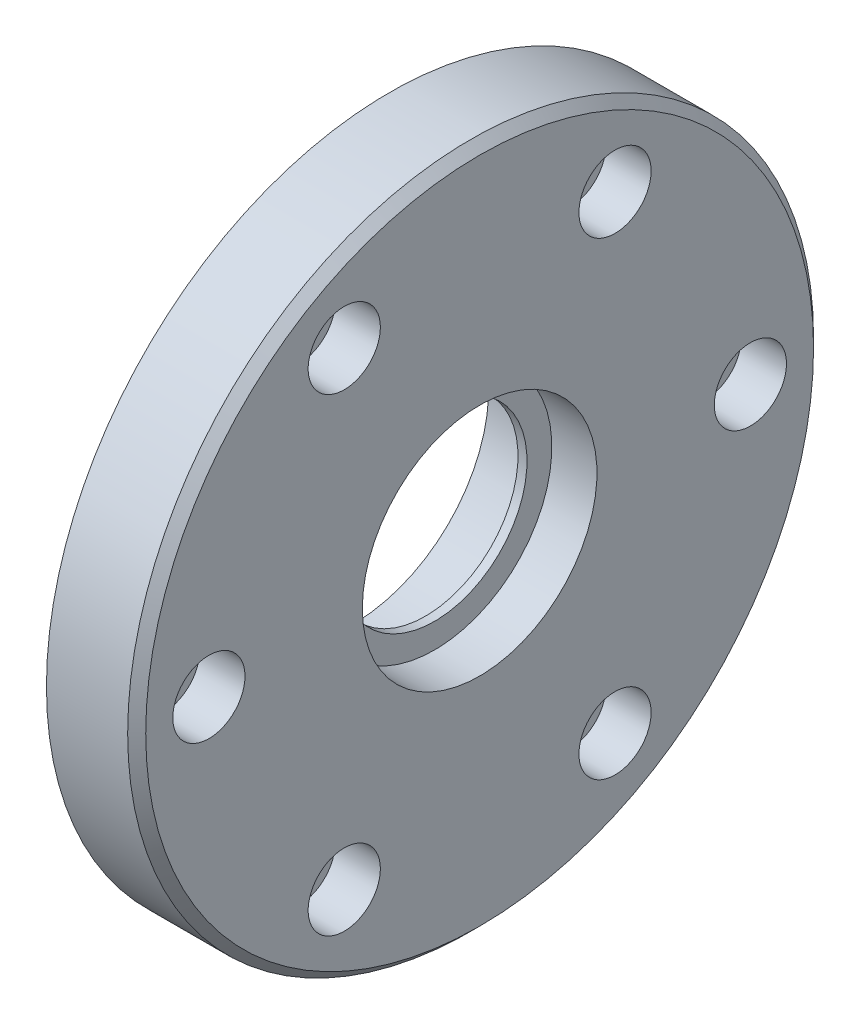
from build123d import *

# Parameters (mm, degrees)
CHANFREIN_1_SIZE                                = 1
CHAMBRAGE_POUR_VIS_T_TE_CYLINDRIQUE_D           = 4.3
CHAMBRAGE_POUR_VIS_T_TE_CYLINDRIQUE_CBORE_D     = 8
CHAMBRAGE_POUR_VIS_T_TE_CYLINDRIQUE_CBORE_DEPTH = 5
R_P_TITION_CIRCULAIRE1_COUNT                    = 6
CHANFREIN_0_5_SIZE                              = 0.5


with BuildPart() as part:
    # Esquisse1 → BASE (revolve)
    with BuildSketch(Plane.XY, mode=Mode.PRIVATE) as base_sk:
        Polygon((-4, 15), (4, 15), (4, 10.25), (5, 10.25), (5, 13), (10, 13), (10, 38), (0, 38), (0, 25), (-1, 25), (-1, 24), (-2.5, 24), (-2.5, 25), (-4, 25), align=None)
    revolve(base_sk.sketch.rotate(Axis((0, 0, 0), (1, 0, 0)), 90), axis=Axis((0, 0, 0), (1, 0, 0)))

    # Chanfrein 1
    chanfrein_1_edges = [part.edges().sort_by_distance(p)[0] for p in [
        (10, 0, -38),
    ]]
    chamfer(chanfrein_1_edges, length=CHANFREIN_1_SIZE)

    # Chambrage pour vis _ t_te cylindrique (through all)
    with Locations(Plane(origin=(10, 0, 0), x_dir=(0, 0, -1), z_dir=(1, 0, 0))):
        with Locations((30, 0)):
            chambrage_pour_vis_t_te_cylindrique = CounterBoreHole(CHAMBRAGE_POUR_VIS_T_TE_CYLINDRIQUE_D / 2, CHAMBRAGE_POUR_VIS_T_TE_CYLINDRIQUE_CBORE_D / 2, CHAMBRAGE_POUR_VIS_T_TE_CYLINDRIQUE_CBORE_DEPTH)

    # R_p_tition circulaire1: Chambrage pour vis _ t_te cylindrique ×6 about axis
    r_p_tition_circulaire1_axis = Axis((0, 0, 0), (1, 0, 0))
    for i in range(1, R_P_TITION_CIRCULAIRE1_COUNT):
        add(chambrage_pour_vis_t_te_cylindrique.rotate(r_p_tition_circulaire1_axis, i * 360 / R_P_TITION_CIRCULAIRE1_COUNT), mode=Mode.SUBTRACT)

    # Chanfrein 0_5
    chanfrein_0_5_edges = [part.edges().sort_by_distance(p)[0] for p in [
        (-4, 0, -25),
    ]]
    chamfer(chanfrein_0_5_edges, length=CHANFREIN_0_5_SIZE)


solid = part.part
